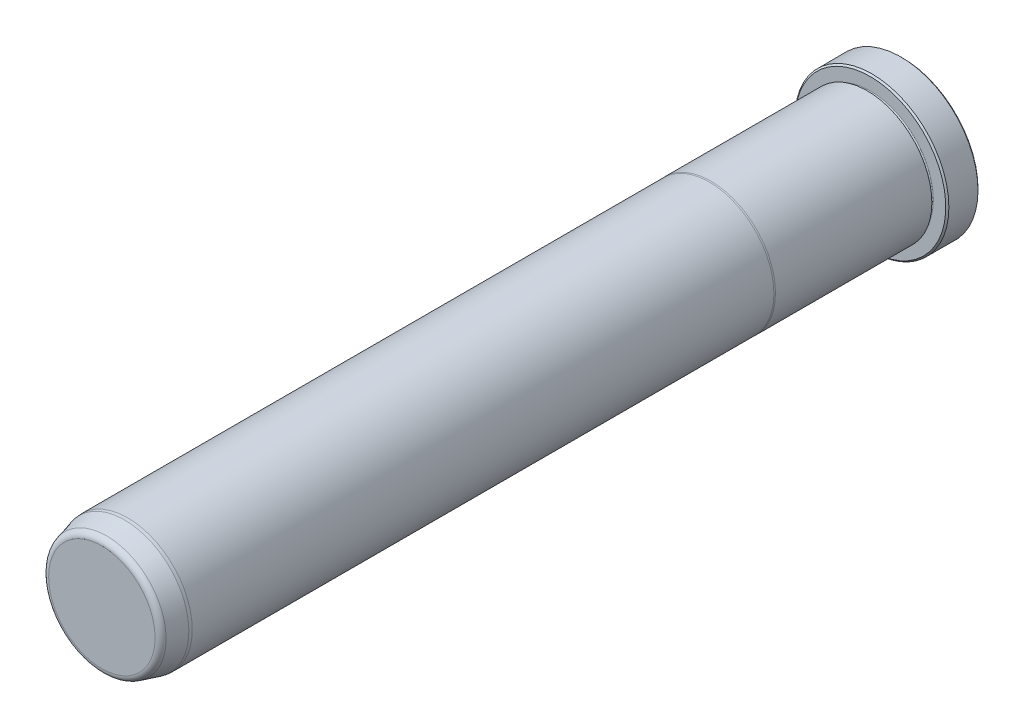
from build123d import *

# Parameters (mm, degrees)
FILLET6_R     = 1.5875
CHAMFER1_SIZE = 0.381


with BuildPart() as part:
    # Sketch1 → Revolve1 (revolve)
    with BuildSketch(Plane(origin=(0, 0, 0), x_dir=(0, 0, -1), z_dir=(1, 0, 0)), mode=Mode.PRIVATE) as revolve1_sk:
        with BuildLine():
            Line((0, 0), (0, 18.923))
            Line((0, 18.923), (-7.9248, 18.923))
            Line((-7.9248, 18.923), (-7.9248, 15.4813))
            ThreePointArc((-7.9248, 15.4813), (-8.3058, 15.1003), (-8.6868, 15.4813))
            Line((-8.6868, 15.4813), (-8.6868, 15.8877))
            Line((-8.6868, 15.8877), (-47.134763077, 15.8877))
            Line((-47.134763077, 15.8877), (-47.498, 15.8623))
            Line((-47.498, 15.8623), (-190.5, 15.8623))
            Line((-190.5, 15.8623), (-191.262, 15.795633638))
            Line((-191.262, 15.795633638), (-196.85, 14.298333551))
            Line((-196.85, 14.298333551), (-196.85, 0))
            Line((-196.85, 0), (0, 0))
        make_face()
    revolve(revolve1_sk.sketch.rotate(Axis((0, 0, 0), (0, 0, -1)), 90), axis=Axis((0, 0, 0), (0, 0, -1)))

    # Fillet6
    fillet6_edges = [part.edges().sort_by_distance(p)[0] for p in [
        (-14.298333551, 0, 196.85),
    ]]
    fillet(fillet6_edges, radius=FILLET6_R)

    # Chamfer1
    chamfer1_edges = [part.edges().sort_by_distance(p)[0] for p in [
        (-18.923, 0, 7.9248),
        (-18.923, 0, 0),
    ]]
    chamfer(chamfer1_edges, length=CHAMFER1_SIZE)


solid = part.part
